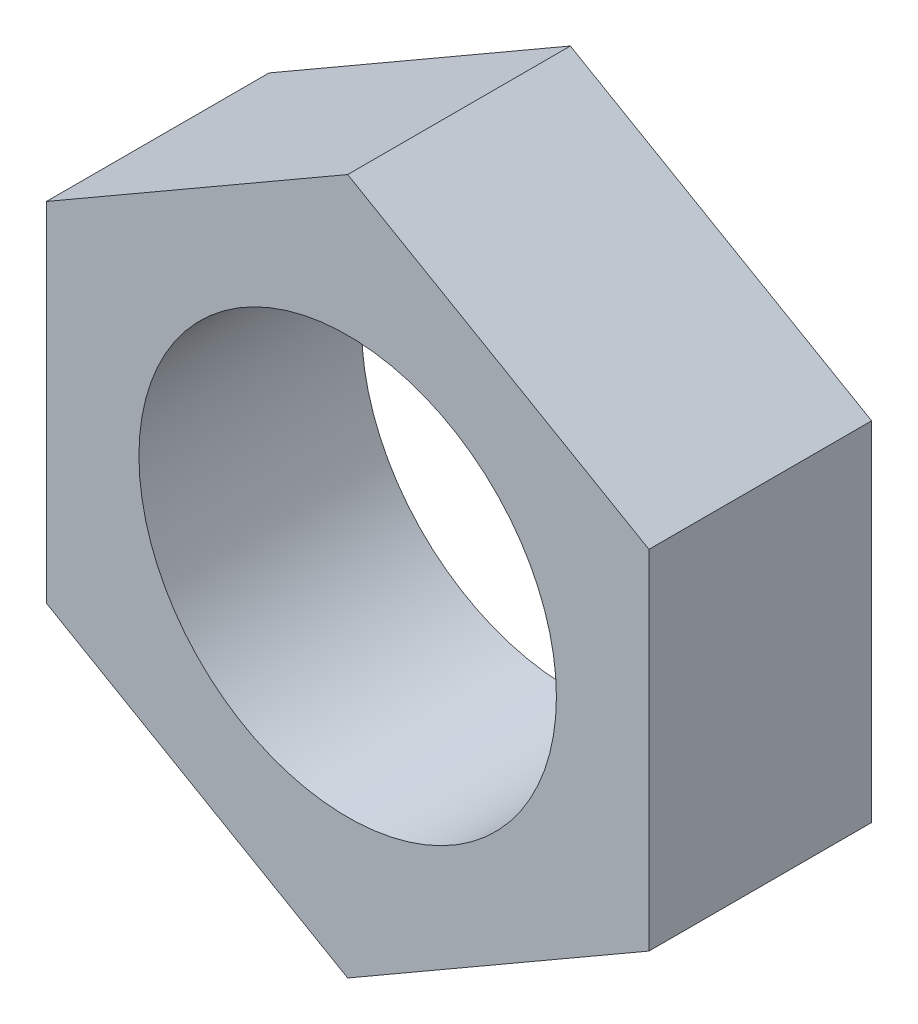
from build123d import *

# Parameters (mm, degrees)
CROQUIS1_R              = 7.5
SALIENTE_EXTRUIR1_DEPTH = 8


with BuildPart() as part:
    # Croquis1 → Saliente-Extruir1 (new body)
    with BuildSketch(Plane.XY):
        Polygon((0, 12.5), (-10.825317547, 6.25), (-10.825317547, -6.25), (0, -12.5), (10.825317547, -6.25), (10.825317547, 6.25), align=None)
        Circle(CROQUIS1_R, mode=Mode.SUBTRACT)
    extrude(amount=SALIENTE_EXTRUIR1_DEPTH)


solid = part.part
